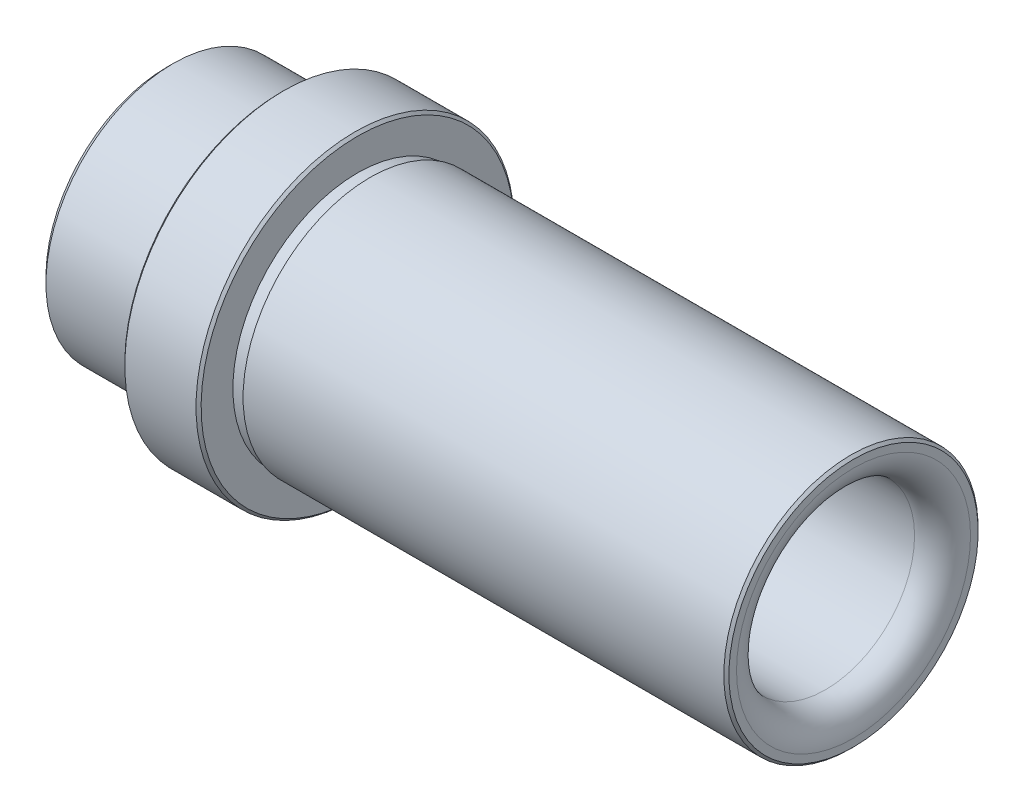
ISO-10303-21;
HEADER;
FILE_DESCRIPTION(('STEP AP214'),'2;1');
FILE_NAME('part.step','',(''),(''),'','','');
FILE_SCHEMA(('AUTOMOTIVE_DESIGN { 1 0 10303 214 1 1 1 1 }'));
ENDSEC;
DATA;
#1=APPLICATION_CONTEXT('core data for automotive mechanical design processes');
#2=APPLICATION_PROTOCOL_DEFINITION('international standard','automotive_design',2000,#1);
#3=PRODUCT_CONTEXT('',#1,'mechanical');
#4=PRODUCT('Part','Part','',(#3));
#5=PRODUCT_RELATED_PRODUCT_CATEGORY('part','',(#4));
#6=PRODUCT_DEFINITION_FORMATION('','',#4);
#7=PRODUCT_DEFINITION_CONTEXT('part definition',#1,'design');
#8=PRODUCT_DEFINITION('design','',#6,#7);
#9=PRODUCT_DEFINITION_SHAPE('','',#8);
#10=(LENGTH_UNIT() NAMED_UNIT(*) SI_UNIT(.MILLI.,.METRE.));
#11=(NAMED_UNIT(*) PLANE_ANGLE_UNIT() SI_UNIT($,.RADIAN.));
#12=(NAMED_UNIT(*) SI_UNIT($,.STERADIAN.) SOLID_ANGLE_UNIT());
#13=UNCERTAINTY_MEASURE_WITH_UNIT(LENGTH_MEASURE(1.E-05),#10,'distance_accuracy_value','');
#14=(GEOMETRIC_REPRESENTATION_CONTEXT(3) GLOBAL_UNCERTAINTY_ASSIGNED_CONTEXT((#13)) GLOBAL_UNIT_ASSIGNED_CONTEXT((#10,
#11,#12)) REPRESENTATION_CONTEXT('',''));
#15=CARTESIAN_POINT('',(0.,0.,0.));
#16=DIRECTION('',(0.,0.,1.));
#17=DIRECTION('',(1.,0.,0.));
#18=AXIS2_PLACEMENT_3D('',#15,#16,#17);
#19=CARTESIAN_POINT('',(-2.90000000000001,60.0000000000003,78.0000000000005));
#20=DIRECTION('',(1.,0.,0.));
#21=DIRECTION('',(0.,0.,-1.));
#22=AXIS2_PLACEMENT_3D('',#19,#20,#21);
#23=TOROIDAL_SURFACE('',#22,9.20000000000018,2.2);
#24=CARTESIAN_POINT('',(-0.700000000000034,60.0000000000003,78.0000000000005));
#25=DIRECTION('',(1.,0.,0.));
#26=DIRECTION('',(0.,1.,0.));
#27=AXIS2_PLACEMENT_3D('',#24,#25,#26);
#28=CIRCLE('',#27,9.2);
#29=CARTESIAN_POINT('',(-0.700000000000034,69.2000000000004,78.0000000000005));
#30=VERTEX_POINT('',#29);
#31=EDGE_CURVE('E50',#30,#30,#28,.T.);
#32=ORIENTED_EDGE('',*,*,#31,.T.);
#33=EDGE_LOOP('',(#32));
#34=FACE_BOUND('',#33,.T.);
#35=CARTESIAN_POINT('',(-2.90000000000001,60.0000000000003,78.0000000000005));
#36=DIRECTION('',(1.,0.,0.));
#37=DIRECTION('',(0.,1.,0.));
#38=AXIS2_PLACEMENT_3D('',#35,#36,#37);
#39=CIRCLE('',#38,7.);
#40=CARTESIAN_POINT('',(-2.90000000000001,67.0000000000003,78.0000000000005));
#41=VERTEX_POINT('',#40);
#42=EDGE_CURVE('E44',#41,#41,#39,.T.);
#43=ORIENTED_EDGE('',*,*,#42,.F.);
#44=EDGE_LOOP('',(#43));
#45=FACE_BOUND('',#44,.T.);
#46=ADVANCED_FACE('F12',(#34,#45),#23,.T.);
#47=CARTESIAN_POINT('',(-0.700000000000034,69.5000000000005,78.0000000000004));
#48=DIRECTION('',(1.,0.,0.));
#49=DIRECTION('',(0.,1.,0.));
#50=AXIS2_PLACEMENT_3D('',#47,#48,#49);
#51=PLANE('',#50);
#52=CARTESIAN_POINT('',(-0.700000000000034,60.0000000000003,78.0000000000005));
#53=DIRECTION('',(1.,0.,0.));
#54=DIRECTION('',(0.,1.,0.));
#55=AXIS2_PLACEMENT_3D('',#52,#53,#54);
#56=CIRCLE('',#55,9.8);
#57=CARTESIAN_POINT('',(-0.700000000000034,69.8000000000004,78.0000000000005));
#58=VERTEX_POINT('',#57);
#59=EDGE_CURVE('E8',#58,#58,#56,.T.);
#60=ORIENTED_EDGE('',*,*,#59,.T.);
#61=EDGE_LOOP('',(#60));
#62=FACE_BOUND('',#61,.T.);
#63=ORIENTED_EDGE('',*,*,#31,.F.);
#64=EDGE_LOOP('',(#63));
#65=FACE_BOUND('',#64,.T.);
#66=ADVANCED_FACE('F99',(#62,#65),#51,.T.);
#67=DIRECTION('',(0.707106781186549,-0.707106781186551,0.));
#68=VECTOR('',#67,1.);
#69=CARTESIAN_POINT('',(-0.800000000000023,69.9000000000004,78.0000000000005));
#70=LINE('',#69,#68);
#71=CARTESIAN_POINT('',(9.1,60.0000000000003,78.0000000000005));
#72=DIRECTION('',(-1.,0.,0.));
#73=AXIS1_PLACEMENT('',#71,#72);
#74=SURFACE_OF_REVOLUTION('',#70,#73);
#75=CARTESIAN_POINT('',(-0.900000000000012,60.0000000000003,78.0000000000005));
#76=DIRECTION('',(1.,0.,0.));
#77=DIRECTION('',(0.,1.,0.));
#78=AXIS2_PLACEMENT_3D('',#75,#76,#77);
#79=CIRCLE('',#78,10.);
#80=CARTESIAN_POINT('',(-0.900000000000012,70.0000000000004,78.0000000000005));
#81=VERTEX_POINT('',#80);
#82=EDGE_CURVE('E45',#81,#81,#79,.T.);
#83=ORIENTED_EDGE('',*,*,#82,.T.);
#84=EDGE_LOOP('',(#83));
#85=FACE_BOUND('',#84,.T.);
#86=ORIENTED_EDGE('',*,*,#59,.F.);
#87=EDGE_LOOP('',(#86));
#88=FACE_BOUND('',#87,.T.);
#89=ADVANCED_FACE('F103',(#85,#88),#74,.F.);
#90=CARTESIAN_POINT('',(-19.8,60.0000000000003,78.0000000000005));
#91=DIRECTION('',(-1.,0.,0.));
#92=DIRECTION('',(0.,0.,1.));
#93=AXIS2_PLACEMENT_3D('',#90,#91,#92);
#94=CYLINDRICAL_SURFACE('',#93,10.);
#95=CARTESIAN_POINT('',(-38.7000000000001,60.0000000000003,78.0000000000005));
#96=DIRECTION('',(1.,0.,0.));
#97=DIRECTION('',(0.,1.,0.));
#98=AXIS2_PLACEMENT_3D('',#95,#96,#97);
#99=CIRCLE('',#98,10.);
#100=CARTESIAN_POINT('',(-38.7000000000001,70.0000000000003,78.0000000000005));
#101=VERTEX_POINT('',#100);
#102=EDGE_CURVE('E49',#101,#101,#99,.T.);
#103=ORIENTED_EDGE('',*,*,#102,.T.);
#104=EDGE_LOOP('',(#103));
#105=FACE_BOUND('',#104,.T.);
#106=ORIENTED_EDGE('',*,*,#82,.F.);
#107=EDGE_LOOP('',(#106));
#108=FACE_BOUND('',#107,.T.);
#109=ADVANCED_FACE('F106',(#105,#108),#94,.T.);
#110=CARTESIAN_POINT('',(-38.7000000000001,69.9000000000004,78.0000000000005));
#111=DIRECTION('',(-1.,0.,0.));
#112=DIRECTION('',(0.,0.,1.));
#113=AXIS2_PLACEMENT_3D('',#110,#111,#112);
#114=PLANE('',#113);
#115=CARTESIAN_POINT('',(-38.7000000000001,60.0000000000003,78.0000000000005));
#116=DIRECTION('',(1.,0.,0.));
#117=DIRECTION('',(0.,1.,0.));
#118=AXIS2_PLACEMENT_3D('',#115,#116,#117);
#119=CIRCLE('',#118,9.8);
#120=CARTESIAN_POINT('',(-38.7000000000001,69.8000000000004,78.0000000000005));
#121=VERTEX_POINT('',#120);
#122=EDGE_CURVE('E21',#121,#121,#119,.T.);
#123=ORIENTED_EDGE('',*,*,#122,.T.);
#124=EDGE_LOOP('',(#123));
#125=FACE_BOUND('',#124,.T.);
#126=ORIENTED_EDGE('',*,*,#102,.F.);
#127=EDGE_LOOP('',(#126));
#128=FACE_BOUND('',#127,.T.);
#129=ADVANCED_FACE('F110',(#125,#128),#114,.T.);
#130=CARTESIAN_POINT('',(-39.2,60.0000000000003,78.0000000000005));
#131=DIRECTION('',(-1.,0.,0.));
#132=DIRECTION('',(0.,0.,1.));
#133=AXIS2_PLACEMENT_3D('',#130,#131,#132);
#134=CYLINDRICAL_SURFACE('',#133,9.8);
#135=CARTESIAN_POINT('',(-39.7000000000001,60.0000000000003,78.0000000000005));
#136=DIRECTION('',(1.,0.,0.));
#137=DIRECTION('',(0.,1.,0.));
#138=AXIS2_PLACEMENT_3D('',#135,#136,#137);
#139=CIRCLE('',#138,9.8);
#140=CARTESIAN_POINT('',(-39.7000000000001,69.8000000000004,78.0000000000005));
#141=VERTEX_POINT('',#140);
#142=EDGE_CURVE('E30',#141,#141,#139,.T.);
#143=ORIENTED_EDGE('',*,*,#142,.T.);
#144=EDGE_LOOP('',(#143));
#145=FACE_BOUND('',#144,.T.);
#146=ORIENTED_EDGE('',*,*,#122,.F.);
#147=EDGE_LOOP('',(#146));
#148=FACE_BOUND('',#147,.T.);
#149=ADVANCED_FACE('F114',(#145,#148),#134,.T.);
#150=CARTESIAN_POINT('',(-39.7000000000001,71.0500000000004,78.0000000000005));
#151=DIRECTION('',(1.,0.,0.));
#152=DIRECTION('',(0.,0.,-1.));
#153=AXIS2_PLACEMENT_3D('',#150,#151,#152);
#154=PLANE('',#153);
#155=CARTESIAN_POINT('',(-39.7000000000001,60.0000000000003,78.0000000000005));
#156=DIRECTION('',(1.,0.,0.));
#157=DIRECTION('',(0.,1.,0.));
#158=AXIS2_PLACEMENT_3D('',#155,#156,#157);
#159=CIRCLE('',#158,12.3);
#160=CARTESIAN_POINT('',(-39.7000000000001,72.3000000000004,78.0000000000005));
#161=VERTEX_POINT('',#160);
#162=EDGE_CURVE('E58',#161,#161,#159,.T.);
#163=ORIENTED_EDGE('',*,*,#162,.T.);
#164=EDGE_LOOP('',(#163));
#165=FACE_BOUND('',#164,.T.);
#166=ORIENTED_EDGE('',*,*,#142,.F.);
#167=EDGE_LOOP('',(#166));
#168=FACE_BOUND('',#167,.T.);
#169=ADVANCED_FACE('F118',(#165,#168),#154,.T.);
#170=DIRECTION('',(0.707106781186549,-0.707106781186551,0.));
#171=VECTOR('',#170,1.);
#172=CARTESIAN_POINT('',(-39.8000000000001,72.4000000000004,78.0000000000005));
#173=LINE('',#172,#171);
#174=CARTESIAN_POINT('',(-27.4,60.0000000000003,78.0000000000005));
#175=DIRECTION('',(-1.,0.,0.));
#176=AXIS1_PLACEMENT('',#174,#175);
#177=SURFACE_OF_REVOLUTION('',#173,#176);
#178=CARTESIAN_POINT('',(-39.9,60.0000000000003,78.0000000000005));
#179=DIRECTION('',(1.,0.,0.));
#180=DIRECTION('',(0.,1.,0.));
#181=AXIS2_PLACEMENT_3D('',#178,#179,#180);
#182=CIRCLE('',#181,12.5);
#183=CARTESIAN_POINT('',(-39.9,72.5000000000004,78.0000000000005));
#184=VERTEX_POINT('',#183);
#185=EDGE_CURVE('E60',#184,#184,#182,.T.);
#186=ORIENTED_EDGE('',*,*,#185,.T.);
#187=EDGE_LOOP('',(#186));
#188=FACE_BOUND('',#187,.T.);
#189=ORIENTED_EDGE('',*,*,#162,.F.);
#190=EDGE_LOOP('',(#189));
#191=FACE_BOUND('',#190,.T.);
#192=ADVANCED_FACE('F122',(#188,#191),#177,.F.);
#193=CARTESIAN_POINT('',(-42.7000000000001,60.0000000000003,78.0000000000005));
#194=DIRECTION('',(-1.,0.,0.));
#195=DIRECTION('',(0.,0.,1.));
#196=AXIS2_PLACEMENT_3D('',#193,#194,#195);
#197=CYLINDRICAL_SURFACE('',#196,12.5);
#198=CARTESIAN_POINT('',(-45.5,60.0000000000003,78.0000000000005));
#199=DIRECTION('',(1.,0.,0.));
#200=DIRECTION('',(0.,1.,0.));
#201=AXIS2_PLACEMENT_3D('',#198,#199,#200);
#202=CIRCLE('',#201,12.5);
#203=CARTESIAN_POINT('',(-45.5,72.5000000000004,78.0000000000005));
#204=VERTEX_POINT('',#203);
#205=EDGE_CURVE('E54',#204,#204,#202,.T.);
#206=ORIENTED_EDGE('',*,*,#205,.T.);
#207=EDGE_LOOP('',(#206));
#208=FACE_BOUND('',#207,.T.);
#209=ORIENTED_EDGE('',*,*,#185,.F.);
#210=EDGE_LOOP('',(#209));
#211=FACE_BOUND('',#210,.T.);
#212=ADVANCED_FACE('F126',(#208,#211),#197,.T.);
#213=DIRECTION('',(-0.707106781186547,-0.707106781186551,0.));
#214=VECTOR('',#213,1.);
#215=CARTESIAN_POINT('',(-45.6000000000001,72.4000000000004,78.0000000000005));
#216=LINE('',#215,#214);
#217=CARTESIAN_POINT('',(-58.,60.0000000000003,78.0000000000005));
#218=DIRECTION('',(1.,0.,0.));
#219=AXIS1_PLACEMENT('',#217,#218);
#220=SURFACE_OF_REVOLUTION('',#216,#219);
#221=CARTESIAN_POINT('',(-45.7000000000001,60.0000000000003,78.0000000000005));
#222=DIRECTION('',(1.,0.,0.));
#223=DIRECTION('',(0.,1.,0.));
#224=AXIS2_PLACEMENT_3D('',#221,#222,#223);
#225=CIRCLE('',#224,12.3);
#226=CARTESIAN_POINT('',(-45.7000000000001,72.3000000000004,78.0000000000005));
#227=VERTEX_POINT('',#226);
#228=EDGE_CURVE('E59',#227,#227,#225,.T.);
#229=ORIENTED_EDGE('',*,*,#228,.T.);
#230=EDGE_LOOP('',(#229));
#231=FACE_BOUND('',#230,.T.);
#232=ORIENTED_EDGE('',*,*,#205,.F.);
#233=EDGE_LOOP('',(#232));
#234=FACE_BOUND('',#233,.T.);
#235=ADVANCED_FACE('F133',(#231,#234),#220,.F.);
#236=CARTESIAN_POINT('',(-45.7000000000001,71.0500000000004,78.0000000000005));
#237=DIRECTION('',(-1.,0.,0.));
#238=DIRECTION('',(0.,0.,1.));
#239=AXIS2_PLACEMENT_3D('',#236,#237,#238);
#240=PLANE('',#239);
#241=CARTESIAN_POINT('',(-45.7000000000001,60.0000000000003,78.0000000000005));
#242=DIRECTION('',(1.,0.,0.));
#243=DIRECTION('',(0.,1.,0.));
#244=AXIS2_PLACEMENT_3D('',#241,#242,#243);
#245=CIRCLE('',#244,9.8);
#246=CARTESIAN_POINT('',(-45.7000000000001,69.8000000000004,78.0000000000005));
#247=VERTEX_POINT('',#246);
#248=EDGE_CURVE('E39',#247,#247,#245,.T.);
#249=ORIENTED_EDGE('',*,*,#248,.T.);
#250=EDGE_LOOP('',(#249));
#251=FACE_BOUND('',#250,.T.);
#252=ORIENTED_EDGE('',*,*,#228,.F.);
#253=EDGE_LOOP('',(#252));
#254=FACE_BOUND('',#253,.T.);
#255=ADVANCED_FACE('F136',(#251,#254),#240,.T.);
#256=CARTESIAN_POINT('',(-46.2,60.0000000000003,78.0000000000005));
#257=DIRECTION('',(-1.,0.,0.));
#258=DIRECTION('',(0.,0.,1.));
#259=AXIS2_PLACEMENT_3D('',#256,#257,#258);
#260=CYLINDRICAL_SURFACE('',#259,9.8);
#261=CARTESIAN_POINT('',(-46.7000000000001,60.0000000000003,78.0000000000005));
#262=DIRECTION('',(1.,0.,0.));
#263=DIRECTION('',(0.,1.,0.));
#264=AXIS2_PLACEMENT_3D('',#261,#262,#263);
#265=CIRCLE('',#264,9.8);
#266=CARTESIAN_POINT('',(-46.7000000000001,69.8000000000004,78.0000000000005));
#267=VERTEX_POINT('',#266);
#268=EDGE_CURVE('E64',#267,#267,#265,.T.);
#269=ORIENTED_EDGE('',*,*,#268,.T.);
#270=EDGE_LOOP('',(#269));
#271=FACE_BOUND('',#270,.T.);
#272=ORIENTED_EDGE('',*,*,#248,.F.);
#273=EDGE_LOOP('',(#272));
#274=FACE_BOUND('',#273,.T.);
#275=ADVANCED_FACE('F140',(#271,#274),#260,.T.);
#276=CARTESIAN_POINT('',(-46.7000000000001,69.9000000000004,78.0000000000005));
#277=DIRECTION('',(1.,0.,0.));
#278=DIRECTION('',(0.,0.,-1.));
#279=AXIS2_PLACEMENT_3D('',#276,#277,#278);
#280=PLANE('',#279);
#281=CARTESIAN_POINT('',(-46.7000000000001,60.0000000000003,78.0000000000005));
#282=DIRECTION('',(1.,0.,0.));
#283=DIRECTION('',(0.,1.,0.));
#284=AXIS2_PLACEMENT_3D('',#281,#282,#283);
#285=CIRCLE('',#284,10.);
#286=CARTESIAN_POINT('',(-46.7000000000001,70.0000000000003,78.0000000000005));
#287=VERTEX_POINT('',#286);
#288=EDGE_CURVE('E35',#287,#287,#285,.T.);
#289=ORIENTED_EDGE('',*,*,#288,.T.);
#290=EDGE_LOOP('',(#289));
#291=FACE_BOUND('',#290,.T.);
#292=ORIENTED_EDGE('',*,*,#268,.F.);
#293=EDGE_LOOP('',(#292));
#294=FACE_BOUND('',#293,.T.);
#295=ADVANCED_FACE('F144',(#291,#294),#280,.T.);
#296=CARTESIAN_POINT('',(-50.45,60.0000000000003,78.0000000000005));
#297=DIRECTION('',(-1.,0.,0.));
#298=DIRECTION('',(0.,0.,1.));
#299=AXIS2_PLACEMENT_3D('',#296,#297,#298);
#300=CYLINDRICAL_SURFACE('',#299,10.);
#301=CARTESIAN_POINT('',(-54.2,60.0000000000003,78.0000000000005));
#302=DIRECTION('',(1.,0.,0.));
#303=DIRECTION('',(0.,1.,0.));
#304=AXIS2_PLACEMENT_3D('',#301,#302,#303);
#305=CIRCLE('',#304,10.);
#306=CARTESIAN_POINT('',(-54.2,70.0000000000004,78.0000000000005));
#307=VERTEX_POINT('',#306);
#308=EDGE_CURVE('E40',#307,#307,#305,.T.);
#309=ORIENTED_EDGE('',*,*,#308,.T.);
#310=EDGE_LOOP('',(#309));
#311=FACE_BOUND('',#310,.T.);
#312=ORIENTED_EDGE('',*,*,#288,.F.);
#313=EDGE_LOOP('',(#312));
#314=FACE_BOUND('',#313,.T.);
#315=ADVANCED_FACE('F148',(#311,#314),#300,.T.);
#316=DIRECTION('',(-0.707106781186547,-0.707106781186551,0.));
#317=VECTOR('',#316,1.);
#318=CARTESIAN_POINT('',(-54.45,69.7500000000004,78.0000000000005));
#319=LINE('',#318,#317);
#320=CARTESIAN_POINT('',(-64.2,60.0000000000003,78.0000000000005));
#321=DIRECTION('',(1.,0.,0.));
#322=AXIS1_PLACEMENT('',#320,#321);
#323=SURFACE_OF_REVOLUTION('',#319,#322);
#324=CARTESIAN_POINT('',(-54.7000000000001,60.0000000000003,78.0000000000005));
#325=DIRECTION('',(1.,0.,0.));
#326=DIRECTION('',(0.,1.,0.));
#327=AXIS2_PLACEMENT_3D('',#324,#325,#326);
#328=CIRCLE('',#327,9.5);
#329=CARTESIAN_POINT('',(-54.7000000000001,69.5000000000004,78.0000000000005));
#330=VERTEX_POINT('',#329);
#331=EDGE_CURVE('E34',#330,#330,#328,.T.);
#332=ORIENTED_EDGE('',*,*,#331,.T.);
#333=EDGE_LOOP('',(#332));
#334=FACE_BOUND('',#333,.T.);
#335=ORIENTED_EDGE('',*,*,#308,.F.);
#336=EDGE_LOOP('',(#335));
#337=FACE_BOUND('',#336,.T.);
#338=ADVANCED_FACE('F152',(#334,#337),#323,.F.);
#339=CARTESIAN_POINT('',(-54.7000000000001,68.5000000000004,78.0000000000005));
#340=DIRECTION('',(-1.,0.,0.));
#341=DIRECTION('',(0.,0.,1.));
#342=AXIS2_PLACEMENT_3D('',#339,#340,#341);
#343=PLANE('',#342);
#344=CARTESIAN_POINT('',(-54.7000000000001,60.0000000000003,78.0000000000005));
#345=DIRECTION('',(1.,0.,0.));
#346=DIRECTION('',(0.,1.,0.));
#347=AXIS2_PLACEMENT_3D('',#344,#345,#346);
#348=CIRCLE('',#347,7.5);
#349=CARTESIAN_POINT('',(-54.7000000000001,67.5000000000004,78.0000000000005));
#350=VERTEX_POINT('',#349);
#351=EDGE_CURVE('E41',#350,#350,#348,.T.);
#352=ORIENTED_EDGE('',*,*,#351,.T.);
#353=EDGE_LOOP('',(#352));
#354=FACE_BOUND('',#353,.T.);
#355=ORIENTED_EDGE('',*,*,#331,.F.);
#356=EDGE_LOOP('',(#355));
#357=FACE_BOUND('',#356,.T.);
#358=ADVANCED_FACE('F156',(#354,#357),#343,.T.);
#359=DIRECTION('',(-0.707106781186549,0.707106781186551,0.));
#360=VECTOR('',#359,1.);
#361=CARTESIAN_POINT('',(-54.45,67.2500000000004,78.0000000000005));
#362=LINE('',#361,#360);
#363=CARTESIAN_POINT('',(-47.2,60.0000000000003,78.0000000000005));
#364=DIRECTION('',(-1.,0.,0.));
#365=AXIS1_PLACEMENT('',#363,#364);
#366=SURFACE_OF_REVOLUTION('',#362,#365);
#367=ORIENTED_EDGE('',*,*,#351,.F.);
#368=EDGE_LOOP('',(#367));
#369=FACE_BOUND('',#368,.T.);
#370=CARTESIAN_POINT('',(-54.2,60.0000000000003,78.0000000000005));
#371=DIRECTION('',(1.,0.,0.));
#372=DIRECTION('',(0.,1.,0.));
#373=AXIS2_PLACEMENT_3D('',#370,#371,#372);
#374=CIRCLE('',#373,7.);
#375=CARTESIAN_POINT('',(-54.2,67.0000000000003,78.0000000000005));
#376=VERTEX_POINT('',#375);
#377=EDGE_CURVE('E68',#376,#376,#374,.T.);
#378=ORIENTED_EDGE('',*,*,#377,.T.);
#379=EDGE_LOOP('',(#378));
#380=FACE_BOUND('',#379,.T.);
#381=ADVANCED_FACE('F159',(#369,#380),#366,.F.);
#382=CARTESIAN_POINT('',(-28.5500000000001,60.0000000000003,78.0000000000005));
#383=DIRECTION('',(-1.,0.,0.));
#384=DIRECTION('',(0.,0.,1.));
#385=AXIS2_PLACEMENT_3D('',#382,#383,#384);
#386=CYLINDRICAL_SURFACE('',#385,7.);
#387=ORIENTED_EDGE('',*,*,#377,.F.);
#388=EDGE_LOOP('',(#387));
#389=FACE_BOUND('',#388,.T.);
#390=ORIENTED_EDGE('',*,*,#42,.T.);
#391=EDGE_LOOP('',(#390));
#392=FACE_BOUND('',#391,.T.);
#393=ADVANCED_FACE('F14',(#389,#392),#386,.F.);
#394=CLOSED_SHELL('',(#46,#66,#89,#109,#129,#149,#169,#192,#212,#235,#255,#275,#295,#315,#338,
#358,#381,#393));
#395=MANIFOLD_SOLID_BREP('B1',#394);
#396=ADVANCED_BREP_SHAPE_REPRESENTATION('',(#18,#395),#14);
#397=SHAPE_DEFINITION_REPRESENTATION(#9,#396);
ENDSEC;
END-ISO-10303-21;
